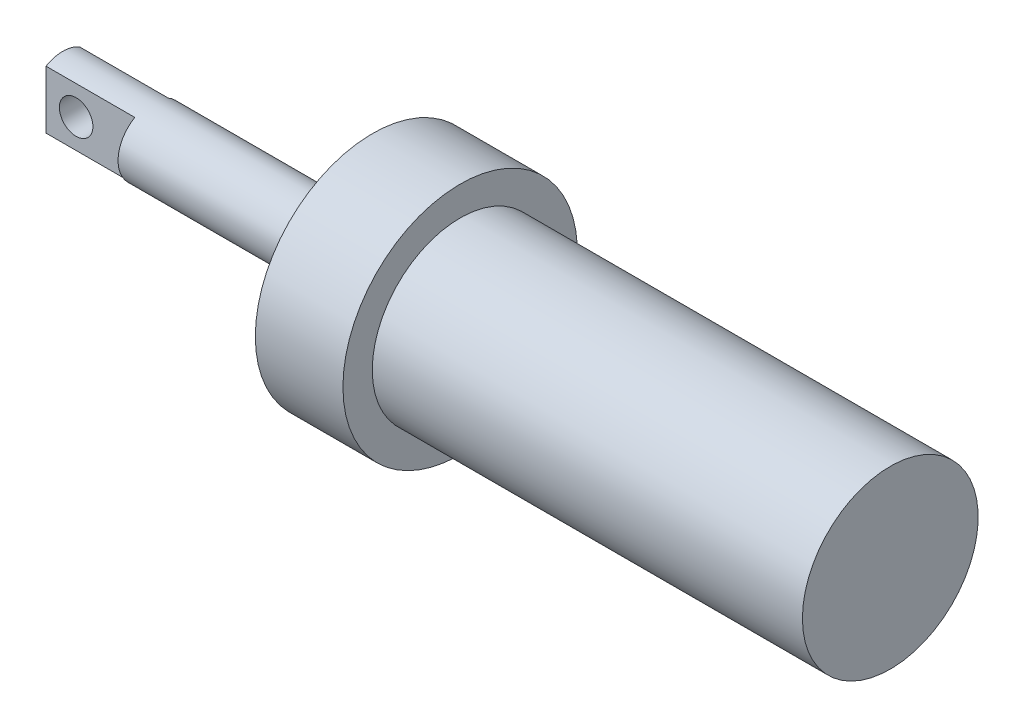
ISO-10303-21;
HEADER;
FILE_DESCRIPTION(('STEP AP214'),'2;1');
FILE_NAME('part.step','',(''),(''),'','','');
FILE_SCHEMA(('AUTOMOTIVE_DESIGN { 1 0 10303 214 1 1 1 1 }'));
ENDSEC;
DATA;
#1=APPLICATION_CONTEXT('core data for automotive mechanical design processes');
#2=APPLICATION_PROTOCOL_DEFINITION('international standard','automotive_design',2000,#1);
#3=PRODUCT_CONTEXT('',#1,'mechanical');
#4=PRODUCT('Part','Part','',(#3));
#5=PRODUCT_RELATED_PRODUCT_CATEGORY('part','',(#4));
#6=PRODUCT_DEFINITION_FORMATION('','',#4);
#7=PRODUCT_DEFINITION_CONTEXT('part definition',#1,'design');
#8=PRODUCT_DEFINITION('design','',#6,#7);
#9=PRODUCT_DEFINITION_SHAPE('','',#8);
#10=(LENGTH_UNIT() NAMED_UNIT(*) SI_UNIT(.MILLI.,.METRE.));
#11=(NAMED_UNIT(*) PLANE_ANGLE_UNIT() SI_UNIT($,.RADIAN.));
#12=(NAMED_UNIT(*) SI_UNIT($,.STERADIAN.) SOLID_ANGLE_UNIT());
#13=UNCERTAINTY_MEASURE_WITH_UNIT(LENGTH_MEASURE(1.E-05),#10,'distance_accuracy_value','');
#14=(GEOMETRIC_REPRESENTATION_CONTEXT(3) GLOBAL_UNCERTAINTY_ASSIGNED_CONTEXT((#13)) GLOBAL_UNIT_ASSIGNED_CONTEXT((#10,
#11,#12)) REPRESENTATION_CONTEXT('',''));
#15=CARTESIAN_POINT('',(0.,0.,0.));
#16=DIRECTION('',(0.,0.,1.));
#17=DIRECTION('',(1.,0.,0.));
#18=AXIS2_PLACEMENT_3D('',#15,#16,#17);
#19=CARTESIAN_POINT('',(-58.7375,0.,0.));
#20=DIRECTION('',(1.,0.,0.));
#21=DIRECTION('',(0.,0.,-1.));
#22=AXIS2_PLACEMENT_3D('',#19,#20,#21);
#23=CYLINDRICAL_SURFACE('',#22,6.35);
#24=CARTESIAN_POINT('',(0.,0.,0.));
#25=DIRECTION('',(-1.,0.,0.));
#26=DIRECTION('',(0.,0.,1.));
#27=AXIS2_PLACEMENT_3D('',#24,#25,#26);
#28=CIRCLE('',#27,6.35);
#29=CARTESIAN_POINT('',(0.,0.,6.35));
#30=VERTEX_POINT('',#29);
#31=EDGE_CURVE('E101',#30,#30,#28,.T.);
#32=ORIENTED_EDGE('',*,*,#31,.T.);
#33=EDGE_LOOP('',(#32));
#34=FACE_BOUND('',#33,.T.);
#35=CARTESIAN_POINT('',(-41.8973,0.,0.));
#36=DIRECTION('',(-1.,0.,0.));
#37=DIRECTION('',(0.,0.,1.));
#38=AXIS2_PLACEMENT_3D('',#35,#36,#37);
#39=CIRCLE('',#38,6.35);
#40=CARTESIAN_POINT('',(-41.8973,-5.49926131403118,3.175));
#41=VERTEX_POINT('',#40);
#42=CARTESIAN_POINT('',(-41.8973,5.49926131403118,3.175));
#43=VERTEX_POINT('',#42);
#44=EDGE_CURVE('E12',#41,#43,#39,.T.);
#45=ORIENTED_EDGE('',*,*,#44,.F.);
#46=DIRECTION('',(1.,0.,0.));
#47=VECTOR('',#46,1.);
#48=CARTESIAN_POINT('',(-58.7375,-5.49926131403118,3.175));
#49=LINE('',#48,#47);
#50=CARTESIAN_POINT('',(-58.7375,-5.49926131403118,3.175));
#51=VERTEX_POINT('',#50);
#52=EDGE_CURVE('E85',#51,#41,#49,.T.);
#53=ORIENTED_EDGE('',*,*,#52,.F.);
#54=CARTESIAN_POINT('',(-58.7375,0.,0.));
#55=DIRECTION('',(-1.,0.,0.));
#56=DIRECTION('',(0.,0.,1.));
#57=AXIS2_PLACEMENT_3D('',#54,#55,#56);
#58=CIRCLE('',#57,6.35);
#59=CARTESIAN_POINT('',(-58.7375,-5.49926131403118,-3.175));
#60=VERTEX_POINT('',#59);
#61=EDGE_CURVE('E93',#60,#51,#58,.T.);
#62=ORIENTED_EDGE('',*,*,#61,.F.);
#63=DIRECTION('',(1.,0.,0.));
#64=VECTOR('',#63,1.);
#65=CARTESIAN_POINT('',(-58.7375,-5.49926131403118,-3.175));
#66=LINE('',#65,#64);
#67=CARTESIAN_POINT('',(-41.8973,-5.49926131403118,-3.175));
#68=VERTEX_POINT('',#67);
#69=EDGE_CURVE('E65',#68,#60,#66,.F.);
#70=ORIENTED_EDGE('',*,*,#69,.F.);
#71=CARTESIAN_POINT('',(-41.8973,0.,0.));
#72=DIRECTION('',(-1.,0.,0.));
#73=DIRECTION('',(0.,0.,1.));
#74=AXIS2_PLACEMENT_3D('',#71,#72,#73);
#75=CIRCLE('',#74,6.35);
#76=CARTESIAN_POINT('',(-41.8973,5.49926131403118,-3.175));
#77=VERTEX_POINT('',#76);
#78=EDGE_CURVE('E90',#77,#68,#75,.T.);
#79=ORIENTED_EDGE('',*,*,#78,.F.);
#80=DIRECTION('',(1.,0.,0.));
#81=VECTOR('',#80,1.);
#82=CARTESIAN_POINT('',(-58.7375,5.49926131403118,-3.175));
#83=LINE('',#82,#81);
#84=CARTESIAN_POINT('',(-58.7375,5.49926131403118,-3.175));
#85=VERTEX_POINT('',#84);
#86=EDGE_CURVE('E104',#85,#77,#83,.T.);
#87=ORIENTED_EDGE('',*,*,#86,.F.);
#88=CARTESIAN_POINT('',(-58.7375,5.49926131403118,3.175));
#89=VERTEX_POINT('',#88);
#90=EDGE_CURVE('E98',#89,#85,#58,.T.);
#91=ORIENTED_EDGE('',*,*,#90,.F.);
#92=DIRECTION('',(1.,0.,0.));
#93=VECTOR('',#92,1.);
#94=CARTESIAN_POINT('',(-58.7375,5.49926131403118,3.175));
#95=LINE('',#94,#93);
#96=EDGE_CURVE('E57',#43,#89,#95,.F.);
#97=ORIENTED_EDGE('',*,*,#96,.F.);
#98=EDGE_LOOP('',(#45,#53,#62,#70,#79,#87,#91,#97));
#99=FACE_BOUND('',#98,.T.);
#100=ADVANCED_FACE('F43',(#34,#99),#23,.T.);
#101=CARTESIAN_POINT('',(-58.7375,0.,0.));
#102=DIRECTION('',(-1.,0.,0.));
#103=DIRECTION('',(0.,0.,1.));
#104=AXIS2_PLACEMENT_3D('',#101,#102,#103);
#105=PLANE('',#104);
#106=ORIENTED_EDGE('',*,*,#61,.T.);
#107=DIRECTION('',(0.,1.,0.));
#108=VECTOR('',#107,1.);
#109=CARTESIAN_POINT('',(-58.7375,0.,3.175));
#110=LINE('',#109,#108);
#111=EDGE_CURVE('E50',#51,#89,#110,.T.);
#112=ORIENTED_EDGE('',*,*,#111,.T.);
#113=ORIENTED_EDGE('',*,*,#90,.T.);
#114=DIRECTION('',(0.,-1.,0.));
#115=VECTOR('',#114,1.);
#116=CARTESIAN_POINT('',(-58.7375,0.,-3.175));
#117=LINE('',#116,#115);
#118=EDGE_CURVE('E97',#85,#60,#117,.T.);
#119=ORIENTED_EDGE('',*,*,#118,.T.);
#120=EDGE_LOOP('',(#106,#112,#113,#119));
#121=FACE_BOUND('',#120,.T.);
#122=ADVANCED_FACE('F96',(#121),#105,.T.);
#123=CARTESIAN_POINT('',(0.,0.,0.));
#124=DIRECTION('',(-1.,0.,0.));
#125=DIRECTION('',(0.,0.,1.));
#126=AXIS2_PLACEMENT_3D('',#123,#124,#125);
#127=PLANE('',#126);
#128=ORIENTED_EDGE('',*,*,#31,.F.);
#129=EDGE_LOOP('',(#128));
#130=FACE_BOUND('',#129,.T.);
#131=ADVANCED_FACE('F144',(#130),#127,.F.);
#132=CARTESIAN_POINT('',(-41.8973,22.225,-3.175));
#133=DIRECTION('',(-1.,0.,0.));
#134=DIRECTION('',(0.,0.,1.));
#135=AXIS2_PLACEMENT_3D('',#132,#133,#134);
#136=PLANE('',#135);
#137=DIRECTION('',(0.,-1.,0.));
#138=VECTOR('',#137,1.);
#139=CARTESIAN_POINT('',(-41.8973,22.225,-3.175));
#140=LINE('',#139,#138);
#141=EDGE_CURVE('E94',#77,#68,#140,.T.);
#142=ORIENTED_EDGE('',*,*,#141,.F.);
#143=ORIENTED_EDGE('',*,*,#78,.T.);
#144=EDGE_LOOP('',(#142,#143));
#145=FACE_BOUND('',#144,.T.);
#146=ADVANCED_FACE('F110',(#145),#136,.T.);
#147=CARTESIAN_POINT('',(-58.7375,22.225,-3.175));
#148=DIRECTION('',(0.,0.,-1.));
#149=DIRECTION('',(-1.,0.,0.));
#150=AXIS2_PLACEMENT_3D('',#147,#148,#149);
#151=PLANE('',#150);
#152=CARTESIAN_POINT('',(-53.0225,0.,-3.175));
#153=DIRECTION('',(0.,0.,-1.));
#154=DIRECTION('',(-1.,0.,0.));
#155=AXIS2_PLACEMENT_3D('',#152,#153,#154);
#156=CIRCLE('',#155,3.175);
#157=CARTESIAN_POINT('',(-49.8475,0.,-3.175));
#158=VERTEX_POINT('',#157);
#159=EDGE_CURVE('E119',#158,#158,#156,.T.);
#160=ORIENTED_EDGE('',*,*,#159,.F.);
#161=EDGE_LOOP('',(#160));
#162=FACE_BOUND('',#161,.T.);
#163=ORIENTED_EDGE('',*,*,#86,.T.);
#164=ORIENTED_EDGE('',*,*,#141,.T.);
#165=ORIENTED_EDGE('',*,*,#69,.T.);
#166=ORIENTED_EDGE('',*,*,#118,.F.);
#167=EDGE_LOOP('',(#163,#164,#165,#166));
#168=FACE_BOUND('',#167,.T.);
#169=ADVANCED_FACE('F113',(#162,#168),#151,.T.);
#170=CARTESIAN_POINT('',(-41.8973,22.225,3.175));
#171=DIRECTION('',(-1.,0.,0.));
#172=DIRECTION('',(0.,0.,1.));
#173=AXIS2_PLACEMENT_3D('',#170,#171,#172);
#174=PLANE('',#173);
#175=ORIENTED_EDGE('',*,*,#44,.T.);
#176=DIRECTION('',(0.,-1.,0.));
#177=VECTOR('',#176,1.);
#178=CARTESIAN_POINT('',(-41.8973,22.225,3.175));
#179=LINE('',#178,#177);
#180=EDGE_CURVE('E117',#43,#41,#179,.T.);
#181=ORIENTED_EDGE('',*,*,#180,.T.);
#182=EDGE_LOOP('',(#175,#181));
#183=FACE_BOUND('',#182,.T.);
#184=ADVANCED_FACE('F129',(#183),#174,.T.);
#185=CARTESIAN_POINT('',(-58.7375,22.225,3.175));
#186=DIRECTION('',(0.,0.,1.));
#187=DIRECTION('',(1.,0.,0.));
#188=AXIS2_PLACEMENT_3D('',#185,#186,#187);
#189=PLANE('',#188);
#190=CARTESIAN_POINT('',(-53.0225,0.,3.175));
#191=DIRECTION('',(0.,0.,1.));
#192=DIRECTION('',(1.,0.,0.));
#193=AXIS2_PLACEMENT_3D('',#190,#191,#192);
#194=CIRCLE('',#193,3.175);
#195=CARTESIAN_POINT('',(-49.8475,0.,3.175));
#196=VERTEX_POINT('',#195);
#197=EDGE_CURVE('E122',#196,#196,#194,.T.);
#198=ORIENTED_EDGE('',*,*,#197,.F.);
#199=EDGE_LOOP('',(#198));
#200=FACE_BOUND('',#199,.T.);
#201=ORIENTED_EDGE('',*,*,#52,.T.);
#202=ORIENTED_EDGE('',*,*,#180,.F.);
#203=ORIENTED_EDGE('',*,*,#96,.T.);
#204=ORIENTED_EDGE('',*,*,#111,.F.);
#205=EDGE_LOOP('',(#201,#202,#203,#204));
#206=FACE_BOUND('',#205,.T.);
#207=ADVANCED_FACE('F84',(#200,#206),#189,.T.);
#208=CARTESIAN_POINT('',(-53.0225,0.,-22.225));
#209=DIRECTION('',(0.,0.,1.));
#210=DIRECTION('',(1.,0.,0.));
#211=AXIS2_PLACEMENT_3D('',#208,#209,#210);
#212=CYLINDRICAL_SURFACE('',#211,3.175);
#213=CARTESIAN_POINT('',(-49.8475,0.,-3.175));
#214=CARTESIAN_POINT('',(-49.8475,0.,-3.10885416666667));
#215=CARTESIAN_POINT('',(-49.8475,0.,-3.04270833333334));
#216=CARTESIAN_POINT('',(-49.8475,0.,-2.91041666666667));
#217=CARTESIAN_POINT('',(-49.8475,0.,-2.84427083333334));
#218=CARTESIAN_POINT('',(-49.8475,0.,-2.71197916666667));
#219=CARTESIAN_POINT('',(-49.8475,0.,-2.64583333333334));
#220=CARTESIAN_POINT('',(-49.8475,0.,-2.51354166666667));
#221=CARTESIAN_POINT('',(-49.8475,0.,-2.44739583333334));
#222=CARTESIAN_POINT('',(-49.8475,0.,-2.31510416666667));
#223=CARTESIAN_POINT('',(-49.8475,0.,-2.24895833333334));
#224=CARTESIAN_POINT('',(-49.8475,0.,-2.11666666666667));
#225=CARTESIAN_POINT('',(-49.8475,0.,-2.05052083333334));
#226=CARTESIAN_POINT('',(-49.8475,0.,-1.91822916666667));
#227=CARTESIAN_POINT('',(-49.8475,0.,-1.85208333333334));
#228=CARTESIAN_POINT('',(-49.8475,0.,-1.71979166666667));
#229=CARTESIAN_POINT('',(-49.8475,0.,-1.65364583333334));
#230=CARTESIAN_POINT('',(-49.8475,0.,-1.52135416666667));
#231=CARTESIAN_POINT('',(-49.8475,0.,-1.45520833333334));
#232=CARTESIAN_POINT('',(-49.8475,0.,-1.32291666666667));
#233=CARTESIAN_POINT('',(-49.8475,0.,-1.25677083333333));
#234=CARTESIAN_POINT('',(-49.8475,0.,-1.12447916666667));
#235=CARTESIAN_POINT('',(-49.8475,0.,-1.05833333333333));
#236=CARTESIAN_POINT('',(-49.8475,0.,-0.926041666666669));
#237=CARTESIAN_POINT('',(-49.8475,0.,-0.859895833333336));
#238=CARTESIAN_POINT('',(-49.8475,0.,-0.727604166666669));
#239=CARTESIAN_POINT('',(-49.8475,0.,-0.661458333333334));
#240=CARTESIAN_POINT('',(-49.8475,0.,-0.529166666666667));
#241=CARTESIAN_POINT('',(-49.8475,0.,-0.463020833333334));
#242=CARTESIAN_POINT('',(-49.8475,0.,-0.330729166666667));
#243=CARTESIAN_POINT('',(-49.8475,0.,-0.264583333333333));
#244=CARTESIAN_POINT('',(-49.8475,0.,-0.132291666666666));
#245=CARTESIAN_POINT('',(-49.8475,0.,-0.066145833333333));
#246=CARTESIAN_POINT('',(-49.8475,0.,0.066145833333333));
#247=CARTESIAN_POINT('',(-49.8475,0.,0.132291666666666));
#248=CARTESIAN_POINT('',(-49.8475,0.,0.264583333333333));
#249=CARTESIAN_POINT('',(-49.8475,0.,0.330729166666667));
#250=CARTESIAN_POINT('',(-49.8475,0.,0.463020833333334));
#251=CARTESIAN_POINT('',(-49.8475,0.,0.529166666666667));
#252=CARTESIAN_POINT('',(-49.8475,0.,0.661458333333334));
#253=CARTESIAN_POINT('',(-49.8475,0.,0.727604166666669));
#254=CARTESIAN_POINT('',(-49.8475,0.,0.859895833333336));
#255=CARTESIAN_POINT('',(-49.8475,0.,0.926041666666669));
#256=CARTESIAN_POINT('',(-49.8475,0.,1.05833333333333));
#257=CARTESIAN_POINT('',(-49.8475,0.,1.12447916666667));
#258=CARTESIAN_POINT('',(-49.8475,0.,1.25677083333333));
#259=CARTESIAN_POINT('',(-49.8475,0.,1.32291666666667));
#260=CARTESIAN_POINT('',(-49.8475,0.,1.45520833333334));
#261=CARTESIAN_POINT('',(-49.8475,0.,1.52135416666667));
#262=CARTESIAN_POINT('',(-49.8475,0.,1.65364583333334));
#263=CARTESIAN_POINT('',(-49.8475,0.,1.71979166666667));
#264=CARTESIAN_POINT('',(-49.8475,0.,1.85208333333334));
#265=CARTESIAN_POINT('',(-49.8475,0.,1.91822916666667));
#266=CARTESIAN_POINT('',(-49.8475,0.,2.05052083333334));
#267=CARTESIAN_POINT('',(-49.8475,0.,2.11666666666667));
#268=CARTESIAN_POINT('',(-49.8475,0.,2.24895833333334));
#269=CARTESIAN_POINT('',(-49.8475,0.,2.31510416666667));
#270=CARTESIAN_POINT('',(-49.8475,0.,2.44739583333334));
#271=CARTESIAN_POINT('',(-49.8475,0.,2.51354166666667));
#272=CARTESIAN_POINT('',(-49.8475,0.,2.64583333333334));
#273=CARTESIAN_POINT('',(-49.8475,0.,2.71197916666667));
#274=CARTESIAN_POINT('',(-49.8475,0.,2.84427083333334));
#275=CARTESIAN_POINT('',(-49.8475,0.,2.91041666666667));
#276=CARTESIAN_POINT('',(-49.8475,0.,3.04270833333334));
#277=CARTESIAN_POINT('',(-49.8475,0.,3.10885416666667));
#278=CARTESIAN_POINT('',(-49.8475,0.,3.175));
#279=B_SPLINE_CURVE_WITH_KNOTS('',3,(#213,#214,#215,#216,#217,#218,#219,#220,#221,#222,#223,
#224,#225,#226,#227,#228,#229,#230,#231,#232,#233,#234,#235,#236,#237,#238,#239,#240,#241,#242,
#243,#244,#245,#246,#247,#248,#249,#250,#251,#252,#253,#254,#255,#256,#257,#258,#259,#260,#261,
#262,#263,#264,#265,#266,#267,#268,#269,#270,#271,#272,#273,#274,#275,#276,#277,#278),
.UNSPECIFIED.,.F.,.F.,(4,2,2,2,2,2,2,2,2,2,2,2,2,2,2,2,2,2,2,2,2,2,2,2,2,2,2,2,2,2,2,2,4),(0.,
0.198437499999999,0.396875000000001,0.5953125,0.793750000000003,0.992187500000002,1.190625,
1.3890625,1.5875,1.7859375,1.984375,2.1828125,2.38125,2.5796875,2.778125,2.97656250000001,3.175,
3.3734375,3.57187500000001,3.7703125,3.96875000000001,4.16718750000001,4.365625,
4.56406250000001,4.76250000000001,4.96093750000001,5.15937500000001,5.35781250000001,
5.55625000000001,5.75468750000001,5.95312500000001,6.15156250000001,6.35000000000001),.UNSPECIFIED.);
#280=EDGE_CURVE('BSEAM126',#158,#196,#279,.T.);
#281=ORIENTED_EDGE('',*,*,#159,.T.);
#282=ORIENTED_EDGE('',*,*,#197,.T.);
#283=ORIENTED_EDGE('',*,*,#280,.T.);
#284=ORIENTED_EDGE('',*,*,#280,.F.);
#285=EDGE_LOOP('',(#281,#283,#282,#284));
#286=FACE_BOUND('',#285,.T.);
#287=ADVANCED_FACE('F126',(#286),#212,.F.);
#288=CLOSED_SHELL('',(#100,#122,#131,#146,#169,#184,#207,#287));
#289=MANIFOLD_SOLID_BREP('B2',#288);
#290=CARTESIAN_POINT('',(0.,0.,0.));
#291=DIRECTION('',(1.,0.,0.));
#292=DIRECTION('',(0.,0.,-1.));
#293=AXIS2_PLACEMENT_3D('',#290,#291,#292);
#294=PLANE('',#293);
#295=CARTESIAN_POINT('',(0.,0.,0.));
#296=DIRECTION('',(-1.,0.,0.));
#297=DIRECTION('',(0.,0.,1.));
#298=AXIS2_PLACEMENT_3D('',#295,#296,#297);
#299=CIRCLE('',#298,22.225);
#300=CARTESIAN_POINT('',(0.,0.,22.225));
#301=VERTEX_POINT('',#300);
#302=EDGE_CURVE('E42',#301,#301,#299,.T.);
#303=ORIENTED_EDGE('',*,*,#302,.T.);
#304=EDGE_LOOP('',(#303));
#305=FACE_BOUND('',#304,.T.);
#306=ADVANCED_FACE('F202',(#305),#294,.F.);
#307=CARTESIAN_POINT('',(0.,0.,0.));
#308=DIRECTION('',(-1.,0.,0.));
#309=DIRECTION('',(0.,0.,1.));
#310=AXIS2_PLACEMENT_3D('',#307,#308,#309);
#311=CYLINDRICAL_SURFACE('',#310,22.225);
#312=ORIENTED_EDGE('',*,*,#302,.F.);
#313=EDGE_LOOP('',(#312));
#314=FACE_BOUND('',#313,.T.);
#315=CARTESIAN_POINT('',(16.6116,0.,0.));
#316=DIRECTION('',(-1.,0.,0.));
#317=DIRECTION('',(0.,0.,1.));
#318=AXIS2_PLACEMENT_3D('',#315,#316,#317);
#319=CIRCLE('',#318,22.225);
#320=CARTESIAN_POINT('',(16.6116,0.,22.225));
#321=VERTEX_POINT('',#320);
#322=EDGE_CURVE('E208',#321,#321,#319,.T.);
#323=ORIENTED_EDGE('',*,*,#322,.T.);
#324=EDGE_LOOP('',(#323));
#325=FACE_BOUND('',#324,.T.);
#326=ADVANCED_FACE('F234',(#314,#325),#311,.T.);
#327=CARTESIAN_POINT('',(16.6116,22.225,0.));
#328=DIRECTION('',(-1.,0.,0.));
#329=DIRECTION('',(0.,0.,1.));
#330=AXIS2_PLACEMENT_3D('',#327,#328,#329);
#331=PLANE('',#330);
#332=ORIENTED_EDGE('',*,*,#322,.F.);
#333=EDGE_LOOP('',(#332));
#334=FACE_BOUND('',#333,.T.);
#335=CARTESIAN_POINT('',(16.6116,0.,0.));
#336=DIRECTION('',(-1.,0.,0.));
#337=DIRECTION('',(0.,0.,1.));
#338=AXIS2_PLACEMENT_3D('',#335,#336,#337);
#339=CIRCLE('',#338,16.6624);
#340=CARTESIAN_POINT('',(16.6116,0.,16.6624));
#341=VERTEX_POINT('',#340);
#342=EDGE_CURVE('E212',#341,#341,#339,.T.);
#343=ORIENTED_EDGE('',*,*,#342,.T.);
#344=EDGE_LOOP('',(#343));
#345=FACE_BOUND('',#344,.T.);
#346=ADVANCED_FACE('F230',(#334,#345),#331,.F.);
#347=CARTESIAN_POINT('',(0.,0.,0.));
#348=DIRECTION('',(-1.,0.,0.));
#349=DIRECTION('',(0.,0.,1.));
#350=AXIS2_PLACEMENT_3D('',#347,#348,#349);
#351=CYLINDRICAL_SURFACE('',#350,16.6624);
#352=ORIENTED_EDGE('',*,*,#342,.F.);
#353=EDGE_LOOP('',(#352));
#354=FACE_BOUND('',#353,.T.);
#355=CARTESIAN_POINT('',(98.171,0.,0.));
#356=DIRECTION('',(-1.,0.,0.));
#357=DIRECTION('',(0.,0.,1.));
#358=AXIS2_PLACEMENT_3D('',#355,#356,#357);
#359=CIRCLE('',#358,16.6624);
#360=CARTESIAN_POINT('',(98.171,0.,16.6624));
#361=VERTEX_POINT('',#360);
#362=EDGE_CURVE('E216',#361,#361,#359,.T.);
#363=ORIENTED_EDGE('',*,*,#362,.T.);
#364=EDGE_LOOP('',(#363));
#365=FACE_BOUND('',#364,.T.);
#366=ADVANCED_FACE('F222',(#354,#365),#351,.T.);
#367=CARTESIAN_POINT('',(98.171,16.6624,0.));
#368=DIRECTION('',(-1.,0.,0.));
#369=DIRECTION('',(0.,0.,1.));
#370=AXIS2_PLACEMENT_3D('',#367,#368,#369);
#371=PLANE('',#370);
#372=ORIENTED_EDGE('',*,*,#362,.F.);
#373=EDGE_LOOP('',(#372));
#374=FACE_BOUND('',#373,.T.);
#375=ADVANCED_FACE('F224',(#374),#371,.F.);
#376=CLOSED_SHELL('',(#306,#326,#346,#366,#375));
#377=MANIFOLD_SOLID_BREP('B6',#376);
#378=ADVANCED_BREP_SHAPE_REPRESENTATION('',(#18,#289,#377),#14);
#379=SHAPE_DEFINITION_REPRESENTATION(#9,#378);
ENDSEC;
END-ISO-10303-21;
